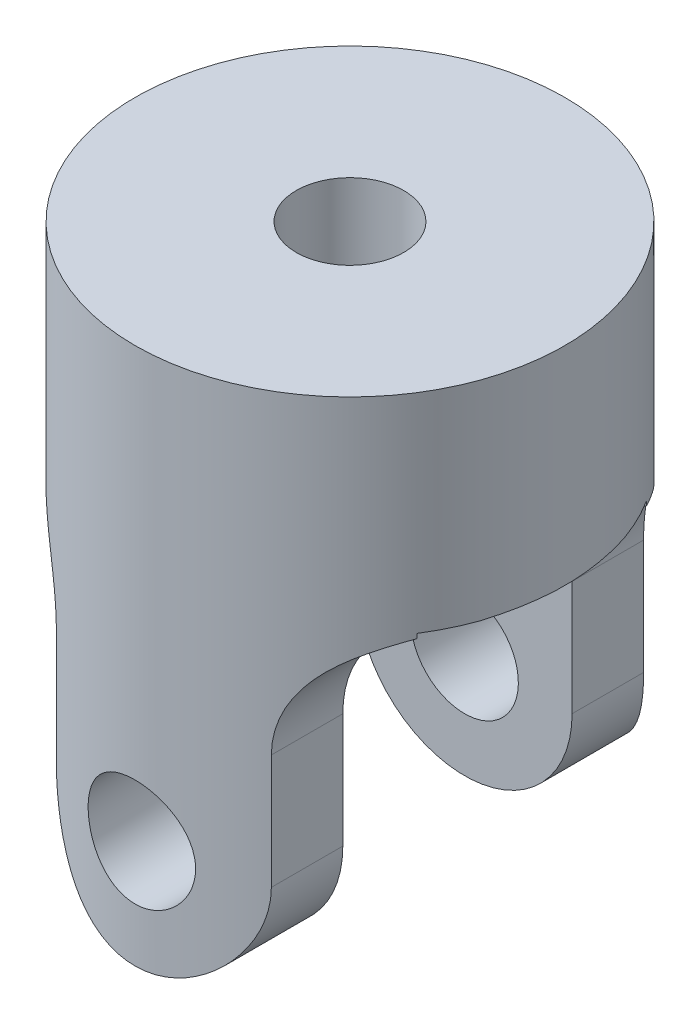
from build123d import *

# Parameters (mm, degrees)
SKETCH1_R               = 19.05
BASE_EXTRUDE_DEPTH      = 47.625
CUT_EXTRUDE1_DEPTH      = 55.716959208
CUT_EXTRUDE1_DEPTH_BACK = 55.716959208
CUT_EXTRUDE5_DEPTH      = 55.716959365
CUT_EXTRUDE5_DEPTH_BACK = 55.716959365
CUT_EXTRUDE6_DEPTH      = 55.716959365
CUT_EXTRUDE6_DEPTH_BACK = 55.716959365
SKETCH11_R              = 4.7625
SKETCH12_R              = 4.7625
CUT_EXTRUDE7_DEPTH      = 55.716959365


with BuildPart() as part:
    # Sketch1 → Base-Extrude (new body)
    with BuildSketch(Plane(origin=(0, 0, 0), x_dir=(-1, 0, 0), z_dir=(0, 1, 0))):
        with Locations(Location((0, 0, 0), (0, 0, 90))):
            Circle(SKETCH1_R)
    extrude(amount=BASE_EXTRUDE_DEPTH)

    # Sketch2 → Cut-Extrude1 (cut, two sides: drawn at the far end of the back side and taken through both)
    with BuildSketch(Plane.XY.offset(-CUT_EXTRUDE1_DEPTH_BACK)):
        with BuildLine():
            Line((-19.05, -131.979516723), (-19.05, 0))
            Line((-19.05, 0), (-19.05, 29.21))
            ThreePointArc((-19.05, 29.21), (-12.314807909, 26.420192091), (-9.525, 19.685))
            Line((-9.525, 19.685), (-9.525, 9.525))
            ThreePointArc((-9.525, 9.525), (0, 0), (9.525, 9.525))
            Line((9.525, 9.525), (9.525, 19.685))
            ThreePointArc((9.525, 19.685), (12.314807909, 26.420192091), (19.05, 29.21))
            Line((19.05, 29.21), (19.05, 0))
            Line((19.05, 0), (19.05, -131.979516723))
            Line((19.05, -131.979516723), (19.05, -395.938550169))
            Line((19.05, -395.938550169), (-19.05, -395.938550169))
            Line((-19.05, -395.938550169), (-19.05, -131.979516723))
        make_face()
    extrude(amount=CUT_EXTRUDE1_DEPTH + CUT_EXTRUDE1_DEPTH_BACK, mode=Mode.SUBTRACT)

    # Sketch8 → Cut-Extrude5 (cut, two sides: drawn at the far end of the back side and taken through both)
    with BuildSketch(Plane(origin=(0, 0, 0), x_dir=(0, 0, -1), z_dir=(1, 0, 0)).offset(-CUT_EXTRUDE5_DEPTH_BACK)):
        Polygon((-10.16, -121.738350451), (-10.16, 0), (-10.16, 29.145238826), (10.16, 29.145238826), (10.16, 0), (10.16, -121.738350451), (10.16, -365.215051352), (-10.16, -365.215051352), align=None)
    extrude(amount=CUT_EXTRUDE5_DEPTH + CUT_EXTRUDE5_DEPTH_BACK, mode=Mode.SUBTRACT)

    # Sketch11 → Cut-Extrude6 (cut, two sides: drawn at the far end of the back side and taken through both)
    with BuildSketch(Plane.XY.offset(-CUT_EXTRUDE6_DEPTH_BACK)):
        with Locations(Location((0, 9.525, 0), (0, 0, 90))):
            Circle(SKETCH11_R)
    extrude(amount=CUT_EXTRUDE6_DEPTH + CUT_EXTRUDE6_DEPTH_BACK, mode=Mode.SUBTRACT)

    # Sketch12 (on Top Plane) → Cut-Extrude7 (cut, through all)
    with BuildSketch(Plane(origin=(0, 0, 0), x_dir=(1, 0, 0), z_dir=(0, 1, 0))):
        with Locations(Location((0, 0, 0), (0, 0, 270))):
            Circle(SKETCH12_R)
    extrude(amount=CUT_EXTRUDE7_DEPTH, mode=Mode.SUBTRACT)


solid = part.part
